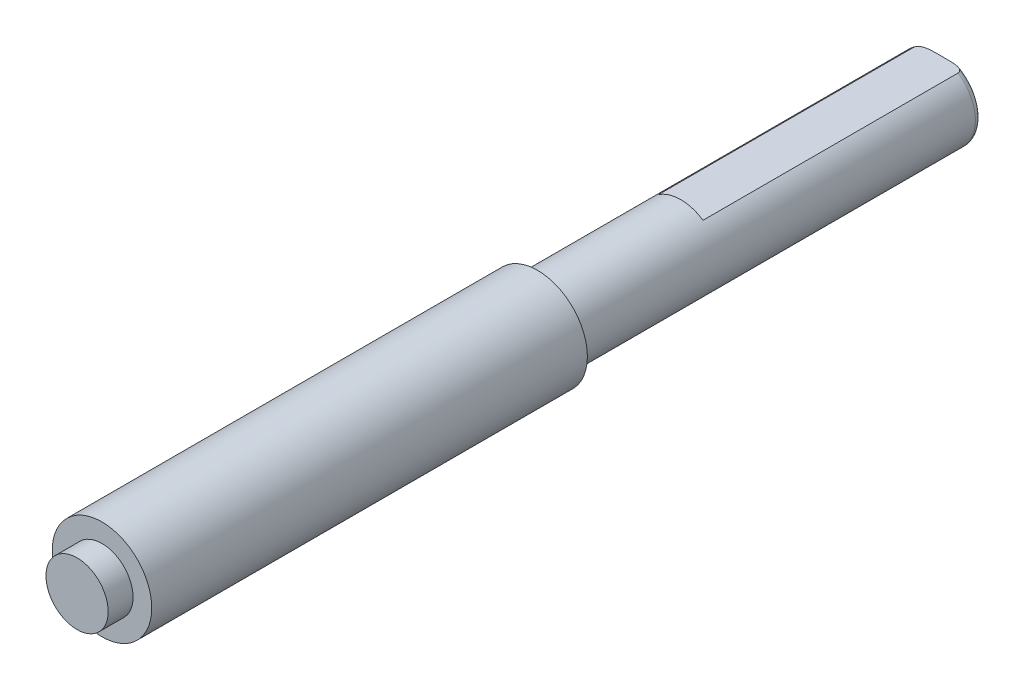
ISO-10303-21;
HEADER;
FILE_DESCRIPTION(('STEP AP214'),'2;1');
FILE_NAME('part.step','',(''),(''),'','','');
FILE_SCHEMA(('AUTOMOTIVE_DESIGN { 1 0 10303 214 1 1 1 1 }'));
ENDSEC;
DATA;
#1=APPLICATION_CONTEXT('core data for automotive mechanical design processes');
#2=APPLICATION_PROTOCOL_DEFINITION('international standard','automotive_design',2000,#1);
#3=PRODUCT_CONTEXT('',#1,'mechanical');
#4=PRODUCT('Part','Part','',(#3));
#5=PRODUCT_RELATED_PRODUCT_CATEGORY('part','',(#4));
#6=PRODUCT_DEFINITION_FORMATION('','',#4);
#7=PRODUCT_DEFINITION_CONTEXT('part definition',#1,'design');
#8=PRODUCT_DEFINITION('design','',#6,#7);
#9=PRODUCT_DEFINITION_SHAPE('','',#8);
#10=(LENGTH_UNIT() NAMED_UNIT(*) SI_UNIT(.MILLI.,.METRE.));
#11=(NAMED_UNIT(*) PLANE_ANGLE_UNIT() SI_UNIT($,.RADIAN.));
#12=(NAMED_UNIT(*) SI_UNIT($,.STERADIAN.) SOLID_ANGLE_UNIT());
#13=UNCERTAINTY_MEASURE_WITH_UNIT(LENGTH_MEASURE(1.E-05),#10,'distance_accuracy_value','');
#14=(GEOMETRIC_REPRESENTATION_CONTEXT(3) GLOBAL_UNCERTAINTY_ASSIGNED_CONTEXT((#13)) GLOBAL_UNIT_ASSIGNED_CONTEXT((#10,
#11,#12)) REPRESENTATION_CONTEXT('',''));
#15=CARTESIAN_POINT('',(0.,0.,0.));
#16=DIRECTION('',(0.,0.,1.));
#17=DIRECTION('',(1.,0.,0.));
#18=AXIS2_PLACEMENT_3D('',#15,#16,#17);
#19=CARTESIAN_POINT('',(0.,0.,67.5));
#20=DIRECTION('',(0.,0.,1.));
#21=DIRECTION('',(1.,0.,0.));
#22=AXIS2_PLACEMENT_3D('',#19,#20,#21);
#23=PLANE('',#22);
#24=CARTESIAN_POINT('',(0.,0.,67.5));
#25=DIRECTION('',(0.,0.,1.));
#26=DIRECTION('',(1.,0.,0.));
#27=AXIS2_PLACEMENT_3D('',#24,#25,#26);
#28=CIRCLE('',#27,4.);
#29=CARTESIAN_POINT('',(4.,0.,67.5));
#30=VERTEX_POINT('',#29);
#31=EDGE_CURVE('E88',#30,#30,#28,.T.);
#32=ORIENTED_EDGE('',*,*,#31,.T.);
#33=EDGE_LOOP('',(#32));
#34=FACE_BOUND('',#33,.T.);
#35=CARTESIAN_POINT('',(0.,0.,67.5));
#36=DIRECTION('',(0.,0.,1.));
#37=DIRECTION('',(1.,0.,0.));
#38=AXIS2_PLACEMENT_3D('',#35,#36,#37);
#39=CIRCLE('',#38,2.5);
#40=CARTESIAN_POINT('',(2.5,0.,67.5));
#41=VERTEX_POINT('',#40);
#42=EDGE_CURVE('E201',#41,#41,#39,.T.);
#43=ORIENTED_EDGE('',*,*,#42,.F.);
#44=EDGE_LOOP('',(#43));
#45=FACE_BOUND('',#44,.T.);
#46=ADVANCED_FACE('F33',(#34,#45),#23,.T.);
#47=CARTESIAN_POINT('',(0.,0.,32.5));
#48=DIRECTION('',(0.,0.,-1.));
#49=DIRECTION('',(-1.,0.,0.));
#50=AXIS2_PLACEMENT_3D('',#47,#48,#49);
#51=CYLINDRICAL_SURFACE('',#50,3.175);
#52=CARTESIAN_POINT('',(0.,0.,32.5));
#53=DIRECTION('',(0.,0.,1.));
#54=DIRECTION('',(1.,0.,0.));
#55=AXIS2_PLACEMENT_3D('',#52,#53,#54);
#56=CIRCLE('',#55,3.175);
#57=CARTESIAN_POINT('',(3.175,0.,32.5));
#58=VERTEX_POINT('',#57);
#59=EDGE_CURVE('E91',#58,#58,#56,.T.);
#60=ORIENTED_EDGE('',*,*,#59,.F.);
#61=EDGE_LOOP('',(#60));
#62=FACE_BOUND('',#61,.T.);
#63=DIRECTION('',(0.,0.,-1.));
#64=VECTOR('',#63,1.);
#65=CARTESIAN_POINT('',(-1.78605710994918,2.625,21.));
#66=LINE('',#65,#64);
#67=CARTESIAN_POINT('',(-1.78605710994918,2.625,21.));
#68=VERTEX_POINT('',#67);
#69=CARTESIAN_POINT('',(-1.78605710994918,2.625,0.500000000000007));
#70=VERTEX_POINT('',#69);
#71=EDGE_CURVE('E77',#68,#70,#66,.T.);
#72=ORIENTED_EDGE('',*,*,#71,.T.);
#73=CARTESIAN_POINT('',(0.,0.,0.5));
#74=DIRECTION('',(0.,0.,1.));
#75=DIRECTION('',(1.,0.,0.));
#76=AXIS2_PLACEMENT_3D('',#73,#74,#75);
#77=CIRCLE('',#76,3.175);
#78=CARTESIAN_POINT('',(1.78605710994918,2.625,0.500000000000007));
#79=VERTEX_POINT('',#78);
#80=EDGE_CURVE('E82',#70,#79,#77,.T.);
#81=ORIENTED_EDGE('',*,*,#80,.T.);
#82=DIRECTION('',(0.,0.,-1.));
#83=VECTOR('',#82,1.);
#84=CARTESIAN_POINT('',(1.78605710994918,2.625,21.));
#85=LINE('',#84,#83);
#86=CARTESIAN_POINT('',(1.78605710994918,2.625,21.));
#87=VERTEX_POINT('',#86);
#88=EDGE_CURVE('E76',#87,#79,#85,.T.);
#89=ORIENTED_EDGE('',*,*,#88,.F.);
#90=CARTESIAN_POINT('',(0.,0.,21.));
#91=DIRECTION('',(0.,0.,-1.));
#92=DIRECTION('',(-1.,0.,0.));
#93=AXIS2_PLACEMENT_3D('',#90,#91,#92);
#94=CIRCLE('',#93,3.175);
#95=EDGE_CURVE('E66',#68,#87,#94,.T.);
#96=ORIENTED_EDGE('',*,*,#95,.F.);
#97=EDGE_LOOP('',(#72,#81,#89,#96));
#98=FACE_BOUND('',#97,.T.);
#99=ADVANCED_FACE('F80',(#62,#98),#51,.T.);
#100=CARTESIAN_POINT('',(0.,0.,0.));
#101=DIRECTION('',(0.,0.,1.));
#102=DIRECTION('',(1.,0.,0.));
#103=AXIS2_PLACEMENT_3D('',#100,#101,#102);
#104=PLANE('',#103);
#105=DIRECTION('',(-1.,0.,0.));
#106=VECTOR('',#105,1.);
#107=CARTESIAN_POINT('',(1.78605710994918,2.625,0.));
#108=LINE('',#107,#106);
#109=CARTESIAN_POINT('',(0.514781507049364,2.625,0.));
#110=VERTEX_POINT('',#109);
#111=CARTESIAN_POINT('',(-0.514781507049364,2.625,0.));
#112=VERTEX_POINT('',#111);
#113=EDGE_CURVE('E73',#110,#112,#108,.T.);
#114=ORIENTED_EDGE('',*,*,#113,.F.);
#115=CARTESIAN_POINT('',(0.,0.,0.));
#116=DIRECTION('',(0.,0.,1.));
#117=DIRECTION('',(1.,0.,0.));
#118=AXIS2_PLACEMENT_3D('',#115,#116,#117);
#119=CIRCLE('',#118,2.675);
#120=EDGE_CURVE('E11',#110,#112,#119,.F.);
#121=ORIENTED_EDGE('',*,*,#120,.T.);
#122=EDGE_LOOP('',(#114,#121));
#123=FACE_BOUND('',#122,.T.);
#124=ADVANCED_FACE('F118',(#123),#104,.F.);
#125=CARTESIAN_POINT('',(0.,0.,32.5));
#126=DIRECTION('',(0.,0.,1.));
#127=DIRECTION('',(1.,0.,0.));
#128=AXIS2_PLACEMENT_3D('',#125,#126,#127);
#129=PLANE('',#128);
#130=CARTESIAN_POINT('',(0.,0.,32.5));
#131=DIRECTION('',(0.,0.,1.));
#132=DIRECTION('',(1.,0.,0.));
#133=AXIS2_PLACEMENT_3D('',#130,#131,#132);
#134=CIRCLE('',#133,4.);
#135=CARTESIAN_POINT('',(4.,0.,32.5));
#136=VERTEX_POINT('',#135);
#137=EDGE_CURVE('E84',#136,#136,#134,.T.);
#138=ORIENTED_EDGE('',*,*,#137,.F.);
#139=EDGE_LOOP('',(#138));
#140=FACE_BOUND('',#139,.T.);
#141=ORIENTED_EDGE('',*,*,#59,.T.);
#142=EDGE_LOOP('',(#141));
#143=FACE_BOUND('',#142,.T.);
#144=ADVANCED_FACE('F115',(#140,#143),#129,.F.);
#145=CARTESIAN_POINT('',(0.,0.,67.5));
#146=DIRECTION('',(0.,0.,-1.));
#147=DIRECTION('',(-1.,0.,0.));
#148=AXIS2_PLACEMENT_3D('',#145,#146,#147);
#149=CYLINDRICAL_SURFACE('',#148,4.);
#150=ORIENTED_EDGE('',*,*,#31,.F.);
#151=EDGE_LOOP('',(#150));
#152=FACE_BOUND('',#151,.T.);
#153=ORIENTED_EDGE('',*,*,#137,.T.);
#154=EDGE_LOOP('',(#153));
#155=FACE_BOUND('',#154,.T.);
#156=ADVANCED_FACE('F109',(#152,#155),#149,.T.);
#157=CARTESIAN_POINT('',(1.78605710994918,2.625,21.));
#158=DIRECTION('',(0.,-1.,0.));
#159=DIRECTION('',(0.,0.,-1.));
#160=AXIS2_PLACEMENT_3D('',#157,#158,#159);
#161=PLANE('',#160);
#162=ORIENTED_EDGE('',*,*,#88,.T.);
#163=CARTESIAN_POINT('',(1.78605710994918,2.625,0.5));
#164=CARTESIAN_POINT('',(1.7861183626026,2.625,0.480515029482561));
#165=CARTESIAN_POINT('',(1.78403706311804,2.625,0.461106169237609));
#166=CARTESIAN_POINT('',(1.77614566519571,2.625,0.423291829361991));
#167=CARTESIAN_POINT('',(1.77038040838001,2.625,0.404877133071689));
#168=CARTESIAN_POINT('',(1.75568721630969,2.625,0.369486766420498));
#169=CARTESIAN_POINT('',(1.74677356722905,2.625,0.352505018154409));
#170=CARTESIAN_POINT('',(1.72641804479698,2.625,0.320088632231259));
#171=CARTESIAN_POINT('',(1.71496821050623,2.625,0.304659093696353));
#172=CARTESIAN_POINT('',(1.68383170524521,2.625,0.26803343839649));
#173=CARTESIAN_POINT('',(1.66291485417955,2.625,0.247887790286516));
#174=CARTESIAN_POINT('',(1.61825721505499,2.625,0.211090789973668));
#175=CARTESIAN_POINT('',(1.59451232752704,2.625,0.194444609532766));
#176=CARTESIAN_POINT('',(1.52776741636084,2.625,0.153457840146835));
#177=CARTESIAN_POINT('',(1.48301267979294,2.625,0.131986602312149));
#178=CARTESIAN_POINT('',(1.41389871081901,2.625,0.104695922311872));
#179=CARTESIAN_POINT('',(1.39041958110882,2.625,0.0963921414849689));
#180=CARTESIAN_POINT('',(1.34299986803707,2.625,0.0812423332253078));
#181=CARTESIAN_POINT('',(1.31905952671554,2.625,0.074395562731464));
#182=CARTESIAN_POINT('',(1.23008070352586,2.625,0.0514093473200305));
#183=CARTESIAN_POINT('',(1.16404779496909,2.625,0.0391500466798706));
#184=CARTESIAN_POINT('',(1.03103589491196,2.625,0.0205768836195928));
#185=CARTESIAN_POINT('',(0.964054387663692,2.625,0.0142841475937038));
#186=CARTESIAN_POINT('',(0.833124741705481,2.625,0.00573297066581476));
#187=CARTESIAN_POINT('',(0.769187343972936,2.625,0.00329337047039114));
#188=CARTESIAN_POINT('',(0.67349457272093,2.625,0.0011481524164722));
#189=CARTESIAN_POINT('',(0.641749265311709,2.625,0.000684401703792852));
#190=CARTESIAN_POINT('',(0.578263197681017,2.625,0.000111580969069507));
#191=CARTESIAN_POINT('',(0.546522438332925,2.625,2.42149440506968E-06));
#192=CARTESIAN_POINT('',(0.514781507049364,2.625,0.));
#193=B_SPLINE_CURVE_WITH_KNOTS('',3,(#163,#164,#165,#166,#167,#168,#169,#170,#171,#172,#173,
#174,#175,#176,#177,#178,#179,#180,#181,#182,#183,#184,#185,#186,#187,#188,#189,#190,#191,#192),
.UNSPECIFIED.,.F.,.F.,(4,2,2,2,2,2,2,2,2,2,2,2,2,2,4),(0.,0.0582234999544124,0.115751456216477,
0.173021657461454,0.230474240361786,0.317101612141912,0.403856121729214,0.551884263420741,
0.62657755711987,0.701232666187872,0.90221485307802,1.10390604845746,1.29579765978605,
1.39104324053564,1.48626479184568),.UNSPECIFIED.);
#194=EDGE_CURVE('E42',#79,#110,#193,.T.);
#195=ORIENTED_EDGE('',*,*,#194,.T.);
#196=ORIENTED_EDGE('',*,*,#113,.T.);
#197=CARTESIAN_POINT('',(-0.514781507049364,2.625,0.));
#198=CARTESIAN_POINT('',(-0.545138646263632,2.625,1.99675866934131E-06));
#199=CARTESIAN_POINT('',(-0.575495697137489,2.625,0.00010207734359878));
#200=CARTESIAN_POINT('',(-0.63621318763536,2.625,0.000620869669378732));
#201=CARTESIAN_POINT('',(-0.666573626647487,2.625,0.00103964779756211));
#202=CARTESIAN_POINT('',(-0.757972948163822,2.625,0.00296465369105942));
#203=CARTESIAN_POINT('',(-0.819003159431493,2.625,0.00514219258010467));
#204=CARTESIAN_POINT('',(-0.941825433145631,2.625,0.0125778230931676));
#205=CARTESIAN_POINT('',(-1.00361494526,2.625,0.0178823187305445));
#206=CARTESIAN_POINT('',(-1.12651560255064,2.625,0.0332527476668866));
#207=CARTESIAN_POINT('',(-1.18762806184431,2.625,0.0433066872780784));
#208=CARTESIAN_POINT('',(-1.28243856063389,2.625,0.0645844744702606));
#209=CARTESIAN_POINT('',(-1.31665689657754,2.625,0.0734587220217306));
#210=CARTESIAN_POINT('',(-1.38423460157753,2.625,0.0940301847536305));
#211=CARTESIAN_POINT('',(-1.41759448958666,2.625,0.105725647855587));
#212=CARTESIAN_POINT('',(-1.48318231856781,2.625,0.132705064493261));
#213=CARTESIAN_POINT('',(-1.51539860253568,2.625,0.148017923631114));
#214=CARTESIAN_POINT('',(-1.57740901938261,2.625,0.182992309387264));
#215=CARTESIAN_POINT('',(-1.60720754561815,2.625,0.202645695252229));
#216=CARTESIAN_POINT('',(-1.65201841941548,2.625,0.238603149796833));
#217=CARTESIAN_POINT('',(-1.66831627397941,2.625,0.253297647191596));
#218=CARTESIAN_POINT('',(-1.69872512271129,2.625,0.28482495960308));
#219=CARTESIAN_POINT('',(-1.71283757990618,2.625,0.301656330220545));
#220=CARTESIAN_POINT('',(-1.73617877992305,2.625,0.334788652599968));
#221=CARTESIAN_POINT('',(-1.74582188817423,2.625,0.350794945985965));
#222=CARTESIAN_POINT('',(-1.76232487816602,2.625,0.38416491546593));
#223=CARTESIAN_POINT('',(-1.76919194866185,2.625,0.401524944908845));
#224=CARTESIAN_POINT('',(-1.77820439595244,2.625,0.432417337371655));
#225=CARTESIAN_POINT('',(-1.78112252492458,2.625,0.445725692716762));
#226=CARTESIAN_POINT('',(-1.78506131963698,2.625,0.472682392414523));
#227=CARTESIAN_POINT('',(-1.78607295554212,2.625,0.486332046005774));
#228=CARTESIAN_POINT('',(-1.78605710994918,2.625,0.500000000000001));
#229=B_SPLINE_CURVE_WITH_KNOTS('',3,(#197,#198,#199,#200,#201,#202,#203,#204,#205,#206,#207,
#208,#209,#210,#211,#212,#213,#214,#215,#216,#217,#218,#219,#220,#221,#222,#223,#224,#225,#226,
#227,#228),.UNSPECIFIED.,.F.,.F.,(4,2,2,2,2,2,2,2,2,2,2,2,2,2,2,4),(0.,0.091070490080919,
0.182159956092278,0.365318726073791,0.551266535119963,0.736747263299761,0.842706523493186,
0.948600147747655,1.05537040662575,1.16194209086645,1.22761113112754,1.2932360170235,
1.34908253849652,1.40478350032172,1.44552659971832,1.4864621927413),.UNSPECIFIED.);
#230=EDGE_CURVE('E97',#112,#70,#229,.T.);
#231=ORIENTED_EDGE('',*,*,#230,.T.);
#232=ORIENTED_EDGE('',*,*,#71,.F.);
#233=DIRECTION('',(-1.,0.,0.));
#234=VECTOR('',#233,1.);
#235=CARTESIAN_POINT('',(1.78605710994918,2.625,21.));
#236=LINE('',#235,#234);
#237=EDGE_CURVE('E69',#87,#68,#236,.T.);
#238=ORIENTED_EDGE('',*,*,#237,.F.);
#239=EDGE_LOOP('',(#162,#195,#196,#231,#232,#238));
#240=FACE_BOUND('',#239,.T.);
#241=ADVANCED_FACE('F75',(#240),#161,.F.);
#242=CARTESIAN_POINT('',(0.,0.,21.));
#243=DIRECTION('',(0.,0.,-1.));
#244=DIRECTION('',(-1.,0.,0.));
#245=AXIS2_PLACEMENT_3D('',#242,#243,#244);
#246=PLANE('',#245);
#247=ORIENTED_EDGE('',*,*,#95,.T.);
#248=ORIENTED_EDGE('',*,*,#237,.T.);
#249=EDGE_LOOP('',(#247,#248));
#250=FACE_BOUND('',#249,.T.);
#251=ADVANCED_FACE('F68',(#250),#246,.T.);
#252=CARTESIAN_POINT('',(0.,0.,0.5));
#253=DIRECTION('',(0.,0.,1.));
#254=DIRECTION('',(1.,0.,0.));
#255=AXIS2_PLACEMENT_3D('',#252,#253,#254);
#256=TOROIDAL_SURFACE('',#255,2.675,0.5);
#257=ORIENTED_EDGE('',*,*,#230,.F.);
#258=ORIENTED_EDGE('',*,*,#120,.F.);
#259=ORIENTED_EDGE('',*,*,#194,.F.);
#260=ORIENTED_EDGE('',*,*,#80,.F.);
#261=EDGE_LOOP('',(#257,#258,#259,#260));
#262=FACE_BOUND('',#261,.T.);
#263=ADVANCED_FACE('F35',(#262),#256,.T.);
#264=CARTESIAN_POINT('',(0.,0.,69.5));
#265=DIRECTION('',(0.,0.,-1.));
#266=DIRECTION('',(-1.,0.,0.));
#267=AXIS2_PLACEMENT_3D('',#264,#265,#266);
#268=CYLINDRICAL_SURFACE('',#267,2.5);
#269=CARTESIAN_POINT('',(0.,0.,69.5));
#270=DIRECTION('',(0.,0.,1.));
#271=DIRECTION('',(1.,0.,0.));
#272=AXIS2_PLACEMENT_3D('',#269,#270,#271);
#273=CIRCLE('',#272,2.5);
#274=CARTESIAN_POINT('',(2.5,0.,69.5));
#275=VERTEX_POINT('',#274);
#276=EDGE_CURVE('E200',#275,#275,#273,.T.);
#277=ORIENTED_EDGE('',*,*,#276,.F.);
#278=EDGE_LOOP('',(#277));
#279=FACE_BOUND('',#278,.T.);
#280=ORIENTED_EDGE('',*,*,#42,.T.);
#281=EDGE_LOOP('',(#280));
#282=FACE_BOUND('',#281,.T.);
#283=ADVANCED_FACE('F159',(#279,#282),#268,.T.);
#284=CARTESIAN_POINT('',(0.,0.,69.5));
#285=DIRECTION('',(0.,0.,1.));
#286=DIRECTION('',(1.,0.,0.));
#287=AXIS2_PLACEMENT_3D('',#284,#285,#286);
#288=PLANE('',#287);
#289=ORIENTED_EDGE('',*,*,#276,.T.);
#290=EDGE_LOOP('',(#289));
#291=FACE_BOUND('',#290,.T.);
#292=ADVANCED_FACE('F166',(#291),#288,.T.);
#293=CLOSED_SHELL('',(#46,#99,#124,#144,#156,#241,#251,#263,#283,#292));
#294=MANIFOLD_SOLID_BREP('B2',#293);
#295=ADVANCED_BREP_SHAPE_REPRESENTATION('',(#18,#294),#14);
#296=SHAPE_DEFINITION_REPRESENTATION(#9,#295);
ENDSEC;
END-ISO-10303-21;
